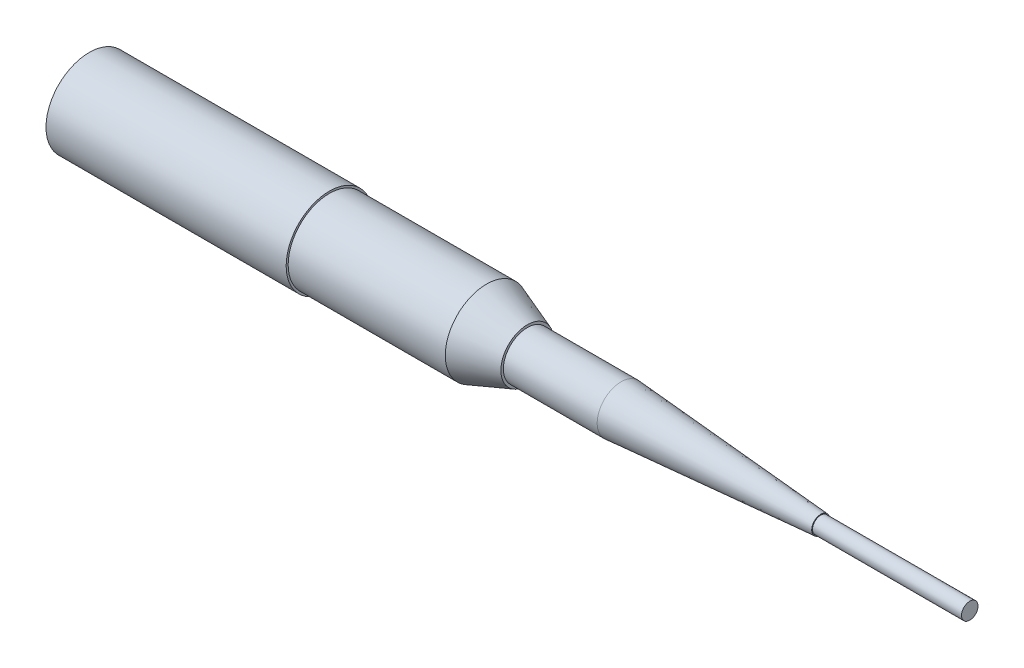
ISO-10303-21;
HEADER;
FILE_DESCRIPTION(('STEP AP214'),'2;1');
FILE_NAME('part.step','',(''),(''),'','','');
FILE_SCHEMA(('AUTOMOTIVE_DESIGN { 1 0 10303 214 1 1 1 1 }'));
ENDSEC;
DATA;
#1=APPLICATION_CONTEXT('core data for automotive mechanical design processes');
#2=APPLICATION_PROTOCOL_DEFINITION('international standard','automotive_design',2000,#1);
#3=PRODUCT_CONTEXT('',#1,'mechanical');
#4=PRODUCT('Part','Part','',(#3));
#5=PRODUCT_RELATED_PRODUCT_CATEGORY('part','',(#4));
#6=PRODUCT_DEFINITION_FORMATION('','',#4);
#7=PRODUCT_DEFINITION_CONTEXT('part definition',#1,'design');
#8=PRODUCT_DEFINITION('design','',#6,#7);
#9=PRODUCT_DEFINITION_SHAPE('','',#8);
#10=(LENGTH_UNIT() NAMED_UNIT(*) SI_UNIT(.MILLI.,.METRE.));
#11=(NAMED_UNIT(*) PLANE_ANGLE_UNIT() SI_UNIT($,.RADIAN.));
#12=(NAMED_UNIT(*) SI_UNIT($,.STERADIAN.) SOLID_ANGLE_UNIT());
#13=UNCERTAINTY_MEASURE_WITH_UNIT(LENGTH_MEASURE(1.E-05),#10,'distance_accuracy_value','');
#14=(GEOMETRIC_REPRESENTATION_CONTEXT(3) GLOBAL_UNCERTAINTY_ASSIGNED_CONTEXT((#13)) GLOBAL_UNIT_ASSIGNED_CONTEXT((#10,
#11,#12)) REPRESENTATION_CONTEXT('',''));
#15=CARTESIAN_POINT('',(0.,0.,0.));
#16=DIRECTION('',(0.,0.,1.));
#17=DIRECTION('',(1.,0.,0.));
#18=AXIS2_PLACEMENT_3D('',#15,#16,#17);
#19=CARTESIAN_POINT('',(-2132.9017278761,-5.77096710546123E-13,0.));
#20=DIRECTION('',(1.,0.,0.));
#21=DIRECTION('',(0.,0.,-1.));
#22=AXIS2_PLACEMENT_3D('',#19,#20,#21);
#23=PLANE('',#22);
#24=CARTESIAN_POINT('',(-2132.9017278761,-43.9928,0.));
#25=DIRECTION('',(-1.,0.,0.));
#26=DIRECTION('',(0.,0.,-1.));
#27=AXIS2_PLACEMENT_3D('',#24,#25,#26);
#28=CIRCLE('',#27,22.2504);
#29=CARTESIAN_POINT('',(-2132.9017278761,-43.9928,-22.2504));
#30=VERTEX_POINT('',#29);
#31=EDGE_CURVE('E78',#30,#30,#28,.T.);
#32=ORIENTED_EDGE('',*,*,#31,.F.);
#33=EDGE_LOOP('',(#32));
#34=FACE_BOUND('',#33,.T.);
#35=CARTESIAN_POINT('',(-2132.9017278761,43.9928,0.));
#36=DIRECTION('',(-1.,0.,0.));
#37=DIRECTION('',(0.,0.,1.));
#38=AXIS2_PLACEMENT_3D('',#35,#36,#37);
#39=CIRCLE('',#38,22.2504);
#40=CARTESIAN_POINT('',(-2132.9017278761,43.9928,22.2504));
#41=VERTEX_POINT('',#40);
#42=EDGE_CURVE('E72',#41,#41,#39,.T.);
#43=ORIENTED_EDGE('',*,*,#42,.F.);
#44=EDGE_LOOP('',(#43));
#45=FACE_BOUND('',#44,.T.);
#46=CARTESIAN_POINT('',(-2132.9017278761,0.,0.));
#47=DIRECTION('',(-1.,0.,0.));
#48=DIRECTION('',(0.,0.,1.));
#49=AXIS2_PLACEMENT_3D('',#46,#47,#48);
#50=CIRCLE('',#49,120.65);
#51=CARTESIAN_POINT('',(-2132.9017278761,0.,120.65));
#52=VERTEX_POINT('',#51);
#53=EDGE_CURVE('E10',#52,#52,#50,.T.);
#54=ORIENTED_EDGE('',*,*,#53,.T.);
#55=EDGE_LOOP('',(#54));
#56=FACE_BOUND('',#55,.T.);
#57=ADVANCED_FACE('F26',(#34,#45,#56),#23,.F.);
#58=CARTESIAN_POINT('',(-2373.70862644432,0.,0.));
#59=DIRECTION('',(-1.,0.,0.));
#60=DIRECTION('',(0.,0.,1.));
#61=AXIS2_PLACEMENT_3D('',#58,#59,#60);
#62=CYLINDRICAL_SURFACE('',#61,120.65);
#63=ORIENTED_EDGE('',*,*,#53,.F.);
#64=EDGE_LOOP('',(#63));
#65=FACE_BOUND('',#64,.T.);
#66=CARTESIAN_POINT('',(-2247.0621279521,0.,0.));
#67=DIRECTION('',(-1.,0.,0.));
#68=DIRECTION('',(0.,0.,1.));
#69=AXIS2_PLACEMENT_3D('',#66,#67,#68);
#70=CIRCLE('',#69,120.65);
#71=CARTESIAN_POINT('',(-2247.0621279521,0.,120.65));
#72=VERTEX_POINT('',#71);
#73=EDGE_CURVE('E32',#72,#72,#70,.T.);
#74=ORIENTED_EDGE('',*,*,#73,.T.);
#75=EDGE_LOOP('',(#74));
#76=FACE_BOUND('',#75,.T.);
#77=ADVANCED_FACE('F86',(#65,#76),#62,.F.);
#78=CARTESIAN_POINT('',(-2247.0621279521,120.65,0.));
#79=DIRECTION('',(1.,0.,0.));
#80=DIRECTION('',(0.,0.,-1.));
#81=AXIS2_PLACEMENT_3D('',#78,#79,#80);
#82=PLANE('',#81);
#83=ORIENTED_EDGE('',*,*,#73,.F.);
#84=EDGE_LOOP('',(#83));
#85=FACE_BOUND('',#84,.T.);
#86=CARTESIAN_POINT('',(-2247.0621279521,0.,0.));
#87=DIRECTION('',(-1.,0.,0.));
#88=DIRECTION('',(0.,0.,1.));
#89=AXIS2_PLACEMENT_3D('',#86,#87,#88);
#90=CIRCLE('',#89,133.1722);
#91=CARTESIAN_POINT('',(-2247.0621279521,0.,133.1722));
#92=VERTEX_POINT('',#91);
#93=EDGE_CURVE('E36',#92,#92,#90,.T.);
#94=ORIENTED_EDGE('',*,*,#93,.T.);
#95=EDGE_LOOP('',(#94));
#96=FACE_BOUND('',#95,.T.);
#97=ADVANCED_FACE('F141',(#85,#96),#82,.F.);
#98=CARTESIAN_POINT('',(-2373.70862644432,0.,0.));
#99=DIRECTION('',(-1.,0.,0.));
#100=DIRECTION('',(0.,0.,1.));
#101=AXIS2_PLACEMENT_3D('',#98,#99,#100);
#102=CYLINDRICAL_SURFACE('',#101,133.1722);
#103=ORIENTED_EDGE('',*,*,#93,.F.);
#104=EDGE_LOOP('',(#103));
#105=FACE_BOUND('',#104,.T.);
#106=CARTESIAN_POINT('',(-1507.1601279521,0.,0.));
#107=DIRECTION('',(-1.,0.,0.));
#108=DIRECTION('',(0.,0.,1.));
#109=AXIS2_PLACEMENT_3D('',#106,#107,#108);
#110=CIRCLE('',#109,133.1722);
#111=CARTESIAN_POINT('',(-1507.1601279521,0.,133.1722));
#112=VERTEX_POINT('',#111);
#113=EDGE_CURVE('E40',#112,#112,#110,.T.);
#114=ORIENTED_EDGE('',*,*,#113,.T.);
#115=EDGE_LOOP('',(#114));
#116=FACE_BOUND('',#115,.T.);
#117=ADVANCED_FACE('F137',(#105,#116),#102,.T.);
#118=CARTESIAN_POINT('',(-1507.1601279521,127.,0.));
#119=DIRECTION('',(-1.,0.,0.));
#120=DIRECTION('',(0.,0.,1.));
#121=AXIS2_PLACEMENT_3D('',#118,#119,#120);
#122=PLANE('',#121);
#123=ORIENTED_EDGE('',*,*,#113,.F.);
#124=EDGE_LOOP('',(#123));
#125=FACE_BOUND('',#124,.T.);
#126=CARTESIAN_POINT('',(-1507.1601279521,0.,0.));
#127=DIRECTION('',(-1.,0.,0.));
#128=DIRECTION('',(0.,0.,1.));
#129=AXIS2_PLACEMENT_3D('',#126,#127,#128);
#130=CIRCLE('',#129,127.);
#131=CARTESIAN_POINT('',(-1507.1601279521,0.,127.));
#132=VERTEX_POINT('',#131);
#133=EDGE_CURVE('E45',#132,#132,#130,.T.);
#134=ORIENTED_EDGE('',*,*,#133,.T.);
#135=EDGE_LOOP('',(#134));
#136=FACE_BOUND('',#135,.T.);
#137=ADVANCED_FACE('F133',(#125,#136),#122,.F.);
#138=CARTESIAN_POINT('',(-2373.70862644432,0.,0.));
#139=DIRECTION('',(-1.,0.,0.));
#140=DIRECTION('',(0.,0.,1.));
#141=AXIS2_PLACEMENT_3D('',#138,#139,#140);
#142=CYLINDRICAL_SURFACE('',#141,127.);
#143=ORIENTED_EDGE('',*,*,#133,.F.);
#144=EDGE_LOOP('',(#143));
#145=FACE_BOUND('',#144,.T.);
#146=CARTESIAN_POINT('',(-1023.1631279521,0.,0.));
#147=DIRECTION('',(-1.,0.,0.));
#148=DIRECTION('',(0.,0.,1.));
#149=AXIS2_PLACEMENT_3D('',#146,#147,#148);
#150=CIRCLE('',#149,127.);
#151=CARTESIAN_POINT('',(-1023.1631279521,0.,127.));
#152=VERTEX_POINT('',#151);
#153=EDGE_CURVE('E48',#152,#152,#150,.T.);
#154=ORIENTED_EDGE('',*,*,#153,.T.);
#155=EDGE_LOOP('',(#154));
#156=FACE_BOUND('',#155,.T.);
#157=ADVANCED_FACE('F129',(#145,#156),#142,.T.);
#158=CARTESIAN_POINT('',(-897.5484603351,0.,0.));
#159=DIRECTION('',(-1.,0.,0.));
#160=DIRECTION('',(0.,0.,1.));
#161=AXIS2_PLACEMENT_3D('',#158,#159,#160);
#162=CONICAL_SURFACE('',#161,81.2800000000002,0.349065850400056);
#163=ORIENTED_EDGE('',*,*,#153,.F.);
#164=EDGE_LOOP('',(#163));
#165=FACE_BOUND('',#164,.T.);
#166=CARTESIAN_POINT('',(-897.5484603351,0.,0.));
#167=DIRECTION('',(-1.,0.,0.));
#168=DIRECTION('',(0.,0.,1.));
#169=AXIS2_PLACEMENT_3D('',#166,#167,#168);
#170=CIRCLE('',#169,81.2800000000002);
#171=CARTESIAN_POINT('',(-897.5484603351,0.,81.2800000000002));
#172=VERTEX_POINT('',#171);
#173=EDGE_CURVE('E51',#172,#172,#170,.T.);
#174=ORIENTED_EDGE('',*,*,#173,.T.);
#175=EDGE_LOOP('',(#174));
#176=FACE_BOUND('',#175,.T.);
#177=ADVANCED_FACE('F125',(#165,#176),#162,.T.);
#178=CARTESIAN_POINT('',(-897.5484603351,73.6600000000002,0.));
#179=DIRECTION('',(-1.,0.,0.));
#180=DIRECTION('',(0.,0.,1.));
#181=AXIS2_PLACEMENT_3D('',#178,#179,#180);
#182=PLANE('',#181);
#183=ORIENTED_EDGE('',*,*,#173,.F.);
#184=EDGE_LOOP('',(#183));
#185=FACE_BOUND('',#184,.T.);
#186=CARTESIAN_POINT('',(-897.5484603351,0.,0.));
#187=DIRECTION('',(-1.,0.,0.));
#188=DIRECTION('',(0.,0.,1.));
#189=AXIS2_PLACEMENT_3D('',#186,#187,#188);
#190=CIRCLE('',#189,73.6600000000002);
#191=CARTESIAN_POINT('',(-897.5484603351,0.,73.6600000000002));
#192=VERTEX_POINT('',#191);
#193=EDGE_CURVE('E54',#192,#192,#190,.T.);
#194=ORIENTED_EDGE('',*,*,#193,.T.);
#195=EDGE_LOOP('',(#194));
#196=FACE_BOUND('',#195,.T.);
#197=ADVANCED_FACE('F121',(#185,#196),#182,.F.);
#198=CARTESIAN_POINT('',(-2373.70862644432,0.,0.));
#199=DIRECTION('',(-1.,0.,0.));
#200=DIRECTION('',(0.,0.,1.));
#201=AXIS2_PLACEMENT_3D('',#198,#199,#200);
#202=CYLINDRICAL_SURFACE('',#201,73.6600000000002);
#203=ORIENTED_EDGE('',*,*,#193,.F.);
#204=EDGE_LOOP('',(#203));
#205=FACE_BOUND('',#204,.T.);
#206=CARTESIAN_POINT('',(-608.5472603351,0.,0.));
#207=DIRECTION('',(-1.,0.,0.));
#208=DIRECTION('',(0.,0.,1.));
#209=AXIS2_PLACEMENT_3D('',#206,#207,#208);
#210=CIRCLE('',#209,73.6600000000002);
#211=CARTESIAN_POINT('',(-608.5472603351,0.,73.6600000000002));
#212=VERTEX_POINT('',#211);
#213=EDGE_CURVE('E57',#212,#212,#210,.T.);
#214=ORIENTED_EDGE('',*,*,#213,.T.);
#215=EDGE_LOOP('',(#214));
#216=FACE_BOUND('',#215,.T.);
#217=ADVANCED_FACE('F117',(#205,#216),#202,.T.);
#218=CARTESIAN_POINT('',(6.69153966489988,0.,0.));
#219=DIRECTION('',(-1.,0.,0.));
#220=DIRECTION('',(0.,0.,1.));
#221=AXIS2_PLACEMENT_3D('',#218,#219,#220);
#222=CONICAL_SURFACE('',#221,27.9400000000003,0.0741762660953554);
#223=ORIENTED_EDGE('',*,*,#213,.F.);
#224=EDGE_LOOP('',(#223));
#225=FACE_BOUND('',#224,.T.);
#226=CARTESIAN_POINT('',(6.69153966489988,0.,0.));
#227=DIRECTION('',(-1.,0.,0.));
#228=DIRECTION('',(0.,0.,1.));
#229=AXIS2_PLACEMENT_3D('',#226,#227,#228);
#230=CIRCLE('',#229,27.9400000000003);
#231=CARTESIAN_POINT('',(6.69153966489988,0.,27.9400000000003));
#232=VERTEX_POINT('',#231);
#233=EDGE_CURVE('E60',#232,#232,#230,.T.);
#234=ORIENTED_EDGE('',*,*,#233,.T.);
#235=EDGE_LOOP('',(#234));
#236=FACE_BOUND('',#235,.T.);
#237=ADVANCED_FACE('F113',(#225,#236),#222,.T.);
#238=CARTESIAN_POINT('',(6.69153966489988,27.9400000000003,0.));
#239=DIRECTION('',(-1.,0.,0.));
#240=DIRECTION('',(0.,0.,1.));
#241=AXIS2_PLACEMENT_3D('',#238,#239,#240);
#242=PLANE('',#241);
#243=ORIENTED_EDGE('',*,*,#233,.F.);
#244=EDGE_LOOP('',(#243));
#245=FACE_BOUND('',#244,.T.);
#246=CARTESIAN_POINT('',(6.69153966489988,0.,0.));
#247=DIRECTION('',(-1.,0.,0.));
#248=DIRECTION('',(0.,0.,1.));
#249=AXIS2_PLACEMENT_3D('',#246,#247,#248);
#250=CIRCLE('',#249,25.4000000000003);
#251=CARTESIAN_POINT('',(6.69153966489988,0.,25.4000000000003));
#252=VERTEX_POINT('',#251);
#253=EDGE_CURVE('E63',#252,#252,#250,.T.);
#254=ORIENTED_EDGE('',*,*,#253,.T.);
#255=EDGE_LOOP('',(#254));
#256=FACE_BOUND('',#255,.T.);
#257=ADVANCED_FACE('F109',(#245,#256),#242,.F.);
#258=CARTESIAN_POINT('',(-2373.70862644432,0.,0.));
#259=DIRECTION('',(-1.,0.,0.));
#260=DIRECTION('',(0.,0.,1.));
#261=AXIS2_PLACEMENT_3D('',#258,#259,#260);
#262=CYLINDRICAL_SURFACE('',#261,25.4000000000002);
#263=ORIENTED_EDGE('',*,*,#253,.F.);
#264=EDGE_LOOP('',(#263));
#265=FACE_BOUND('',#264,.T.);
#266=CARTESIAN_POINT('',(465.766227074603,0.,0.));
#267=DIRECTION('',(-1.,0.,0.));
#268=DIRECTION('',(0.,0.,1.));
#269=AXIS2_PLACEMENT_3D('',#266,#267,#268);
#270=CIRCLE('',#269,25.4);
#271=CARTESIAN_POINT('',(465.766227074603,0.,25.4));
#272=VERTEX_POINT('',#271);
#273=EDGE_CURVE('E66',#272,#272,#270,.T.);
#274=ORIENTED_EDGE('',*,*,#273,.T.);
#275=EDGE_LOOP('',(#274));
#276=FACE_BOUND('',#275,.T.);
#277=ADVANCED_FACE('F101',(#265,#276),#262,.T.);
#278=CARTESIAN_POINT('',(465.766227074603,0.,0.));
#279=DIRECTION('',(-1.,0.,0.));
#280=DIRECTION('',(0.,0.,1.));
#281=AXIS2_PLACEMENT_3D('',#278,#279,#280);
#282=PLANE('',#281);
#283=ORIENTED_EDGE('',*,*,#273,.F.);
#284=EDGE_LOOP('',(#283));
#285=FACE_BOUND('',#284,.T.);
#286=ADVANCED_FACE('F92',(#285),#282,.F.);
#287=CARTESIAN_POINT('',(-2107.5017278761,43.9928,0.));
#288=DIRECTION('',(-1.,0.,0.));
#289=DIRECTION('',(0.,0.,1.));
#290=AXIS2_PLACEMENT_3D('',#287,#288,#289);
#291=CYLINDRICAL_SURFACE('',#290,22.2504);
#292=CARTESIAN_POINT('',(-2107.5017278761,43.9928,0.));
#293=DIRECTION('',(-1.,0.,0.));
#294=DIRECTION('',(0.,0.,1.));
#295=AXIS2_PLACEMENT_3D('',#292,#293,#294);
#296=CIRCLE('',#295,22.2504);
#297=CARTESIAN_POINT('',(-2107.5017278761,43.9928,22.2504));
#298=VERTEX_POINT('',#297);
#299=EDGE_CURVE('E69',#298,#298,#296,.T.);
#300=ORIENTED_EDGE('',*,*,#299,.F.);
#301=EDGE_LOOP('',(#300));
#302=FACE_BOUND('',#301,.T.);
#303=ORIENTED_EDGE('',*,*,#42,.T.);
#304=EDGE_LOOP('',(#303));
#305=FACE_BOUND('',#304,.T.);
#306=ADVANCED_FACE('F89',(#302,#305),#291,.F.);
#307=CARTESIAN_POINT('',(-2107.5017278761,43.9928,0.));
#308=DIRECTION('',(-1.,0.,0.));
#309=DIRECTION('',(0.,0.,1.));
#310=AXIS2_PLACEMENT_3D('',#307,#308,#309);
#311=PLANE('',#310);
#312=ORIENTED_EDGE('',*,*,#299,.T.);
#313=EDGE_LOOP('',(#312));
#314=FACE_BOUND('',#313,.T.);
#315=ADVANCED_FACE('F91',(#314),#311,.T.);
#316=CARTESIAN_POINT('',(-2107.5017278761,-43.9928,0.));
#317=DIRECTION('',(-1.,0.,0.));
#318=DIRECTION('',(0.,0.,1.));
#319=AXIS2_PLACEMENT_3D('',#316,#317,#318);
#320=CYLINDRICAL_SURFACE('',#319,22.2504);
#321=CARTESIAN_POINT('',(-2107.5017278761,-43.9928,0.));
#322=DIRECTION('',(-1.,0.,0.));
#323=DIRECTION('',(0.,0.,-1.));
#324=AXIS2_PLACEMENT_3D('',#321,#322,#323);
#325=CIRCLE('',#324,22.2504);
#326=CARTESIAN_POINT('',(-2107.5017278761,-43.9928,-22.2504));
#327=VERTEX_POINT('',#326);
#328=EDGE_CURVE('E75',#327,#327,#325,.T.);
#329=ORIENTED_EDGE('',*,*,#328,.F.);
#330=EDGE_LOOP('',(#329));
#331=FACE_BOUND('',#330,.T.);
#332=ORIENTED_EDGE('',*,*,#31,.T.);
#333=EDGE_LOOP('',(#332));
#334=FACE_BOUND('',#333,.T.);
#335=ADVANCED_FACE('F82',(#331,#334),#320,.F.);
#336=CARTESIAN_POINT('',(-2107.5017278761,-43.9928,0.));
#337=DIRECTION('',(1.,0.,0.));
#338=DIRECTION('',(0.,0.,-1.));
#339=AXIS2_PLACEMENT_3D('',#336,#337,#338);
#340=PLANE('',#339);
#341=ORIENTED_EDGE('',*,*,#328,.T.);
#342=EDGE_LOOP('',(#341));
#343=FACE_BOUND('',#342,.T.);
#344=ADVANCED_FACE('F210',(#343),#340,.F.);
#345=CLOSED_SHELL('',(#57,#77,#97,#117,#137,#157,#177,#197,#217,#237,#257,#277,#286,#306,#315,
#335,#344));
#346=MANIFOLD_SOLID_BREP('B2',#345);
#347=ADVANCED_BREP_SHAPE_REPRESENTATION('',(#18,#346),#14);
#348=SHAPE_DEFINITION_REPRESENTATION(#9,#347);
ENDSEC;
END-ISO-10303-21;
